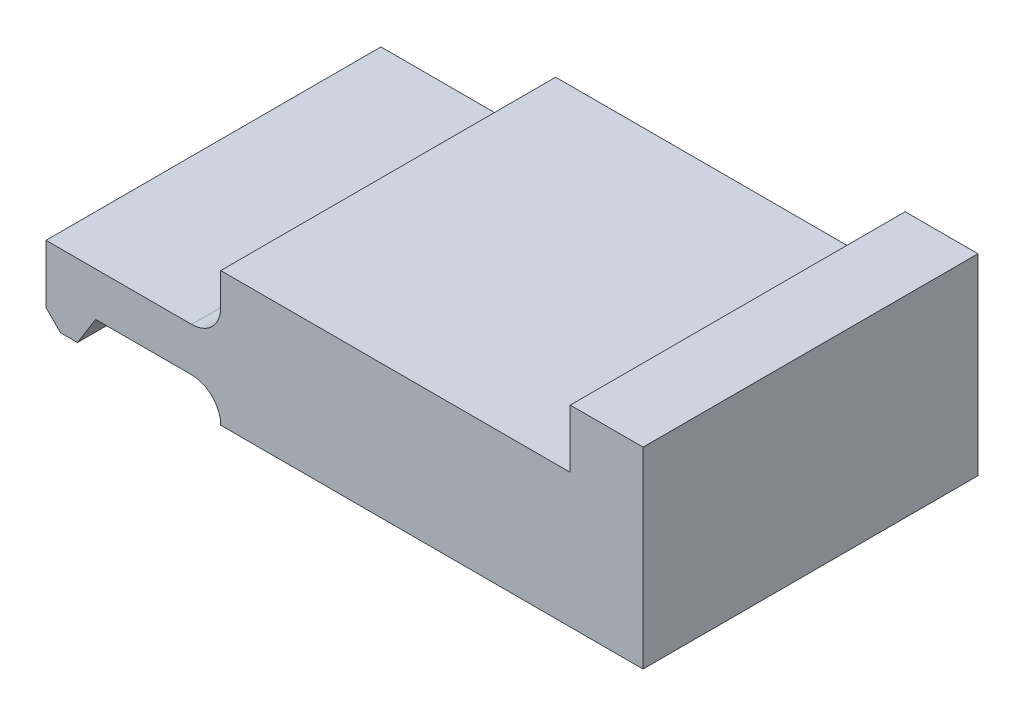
ISO-10303-21;
HEADER;
FILE_DESCRIPTION(('STEP AP214'),'2;1');
FILE_NAME('part.step','',(''),(''),'','','');
FILE_SCHEMA(('AUTOMOTIVE_DESIGN { 1 0 10303 214 1 1 1 1 }'));
ENDSEC;
DATA;
#1=APPLICATION_CONTEXT('core data for automotive mechanical design processes');
#2=APPLICATION_PROTOCOL_DEFINITION('international standard','automotive_design',2000,#1);
#3=PRODUCT_CONTEXT('',#1,'mechanical');
#4=PRODUCT('Part','Part','',(#3));
#5=PRODUCT_RELATED_PRODUCT_CATEGORY('part','',(#4));
#6=PRODUCT_DEFINITION_FORMATION('','',#4);
#7=PRODUCT_DEFINITION_CONTEXT('part definition',#1,'design');
#8=PRODUCT_DEFINITION('design','',#6,#7);
#9=PRODUCT_DEFINITION_SHAPE('','',#8);
#10=(LENGTH_UNIT() NAMED_UNIT(*) SI_UNIT(.MILLI.,.METRE.));
#11=(NAMED_UNIT(*) PLANE_ANGLE_UNIT() SI_UNIT($,.RADIAN.));
#12=(NAMED_UNIT(*) SI_UNIT($,.STERADIAN.) SOLID_ANGLE_UNIT());
#13=UNCERTAINTY_MEASURE_WITH_UNIT(LENGTH_MEASURE(1.E-05),#10,'distance_accuracy_value','');
#14=(GEOMETRIC_REPRESENTATION_CONTEXT(3) GLOBAL_UNCERTAINTY_ASSIGNED_CONTEXT((#13)) GLOBAL_UNIT_ASSIGNED_CONTEXT((#10,
#11,#12)) REPRESENTATION_CONTEXT('',''));
#15=CARTESIAN_POINT('',(0.,0.,0.));
#16=DIRECTION('',(0.,0.,1.));
#17=DIRECTION('',(1.,0.,0.));
#18=AXIS2_PLACEMENT_3D('',#15,#16,#17);
#19=CARTESIAN_POINT('',(0.,0.5,5.75));
#20=DIRECTION('',(0.707106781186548,0.707106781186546,0.));
#21=DIRECTION('',(-0.707106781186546,0.707106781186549,0.));
#22=AXIS2_PLACEMENT_3D('',#19,#20,#21);
#23=PLANE('',#22);
#24=DIRECTION('',(0.707106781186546,-0.707106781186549,0.));
#25=VECTOR('',#24,1.);
#26=CARTESIAN_POINT('',(0.,0.5,-5.75));
#27=LINE('',#26,#25);
#28=CARTESIAN_POINT('',(0.,0.5,-5.75));
#29=VERTEX_POINT('',#28);
#30=CARTESIAN_POINT('',(0.499999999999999,0.,-5.75));
#31=VERTEX_POINT('',#30);
#32=EDGE_CURVE('E147',#29,#31,#27,.T.);
#33=ORIENTED_EDGE('',*,*,#32,.T.);
#34=DIRECTION('',(0.,0.,-1.));
#35=VECTOR('',#34,1.);
#36=CARTESIAN_POINT('',(0.499999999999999,0.,5.75));
#37=LINE('',#36,#35);
#38=CARTESIAN_POINT('',(0.499999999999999,0.,5.75));
#39=VERTEX_POINT('',#38);
#40=EDGE_CURVE('E11',#39,#31,#37,.T.);
#41=ORIENTED_EDGE('',*,*,#40,.F.);
#42=DIRECTION('',(0.707106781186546,-0.707106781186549,0.));
#43=VECTOR('',#42,1.);
#44=CARTESIAN_POINT('',(0.,0.5,5.75));
#45=LINE('',#44,#43);
#46=CARTESIAN_POINT('',(0.,0.5,5.75));
#47=VERTEX_POINT('',#46);
#48=EDGE_CURVE('E169',#47,#39,#45,.T.);
#49=ORIENTED_EDGE('',*,*,#48,.F.);
#50=DIRECTION('',(0.,0.,-1.));
#51=VECTOR('',#50,1.);
#52=CARTESIAN_POINT('',(0.,0.5,5.75));
#53=LINE('',#52,#51);
#54=EDGE_CURVE('E143',#47,#29,#53,.T.);
#55=ORIENTED_EDGE('',*,*,#54,.T.);
#56=EDGE_LOOP('',(#33,#41,#49,#55));
#57=FACE_BOUND('',#56,.T.);
#58=ADVANCED_FACE('F33',(#57),#23,.F.);
#59=CARTESIAN_POINT('',(0.499999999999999,0.,5.75));
#60=DIRECTION('',(0.,1.,0.));
#61=DIRECTION('',(0.,0.,1.));
#62=AXIS2_PLACEMENT_3D('',#59,#60,#61);
#63=PLANE('',#62);
#64=DIRECTION('',(1.,0.,0.));
#65=VECTOR('',#64,1.);
#66=CARTESIAN_POINT('',(0.499999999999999,0.,-5.75));
#67=LINE('',#66,#65);
#68=CARTESIAN_POINT('',(1.08024189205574,0.,-5.75));
#69=VERTEX_POINT('',#68);
#70=EDGE_CURVE('E150',#31,#69,#67,.T.);
#71=ORIENTED_EDGE('',*,*,#70,.T.);
#72=DIRECTION('',(0.,0.,-1.));
#73=VECTOR('',#72,1.);
#74=CARTESIAN_POINT('',(1.08024189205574,0.,5.75));
#75=LINE('',#74,#73);
#76=CARTESIAN_POINT('',(1.08024189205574,0.,5.75));
#77=VERTEX_POINT('',#76);
#78=EDGE_CURVE('E41',#77,#69,#75,.T.);
#79=ORIENTED_EDGE('',*,*,#78,.F.);
#80=DIRECTION('',(1.,0.,0.));
#81=VECTOR('',#80,1.);
#82=CARTESIAN_POINT('',(0.499999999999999,0.,5.75));
#83=LINE('',#82,#81);
#84=EDGE_CURVE('E102',#39,#77,#83,.T.);
#85=ORIENTED_EDGE('',*,*,#84,.F.);
#86=ORIENTED_EDGE('',*,*,#40,.T.);
#87=EDGE_LOOP('',(#71,#79,#85,#86));
#88=FACE_BOUND('',#87,.T.);
#89=ADVANCED_FACE('F245',(#88),#63,.F.);
#90=CARTESIAN_POINT('',(1.08024189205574,0.,5.75));
#91=DIRECTION('',(-0.848343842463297,0.529445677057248,0.));
#92=DIRECTION('',(-0.529445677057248,-0.848343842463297,0.));
#93=AXIS2_PLACEMENT_3D('',#90,#91,#92);
#94=PLANE('',#93);
#95=DIRECTION('',(0.529445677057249,0.848343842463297,0.));
#96=VECTOR('',#95,1.);
#97=CARTESIAN_POINT('',(1.08024189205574,0.,-5.75));
#98=LINE('',#97,#96);
#99=CARTESIAN_POINT('',(1.70433515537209,1.,-5.75));
#100=VERTEX_POINT('',#99);
#101=EDGE_CURVE('E153',#69,#100,#98,.T.);
#102=ORIENTED_EDGE('',*,*,#101,.T.);
#103=DIRECTION('',(0.,0.,-1.));
#104=VECTOR('',#103,1.);
#105=CARTESIAN_POINT('',(1.70433515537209,1.,5.75));
#106=LINE('',#105,#104);
#107=CARTESIAN_POINT('',(1.70433515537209,1.,5.75));
#108=VERTEX_POINT('',#107);
#109=EDGE_CURVE('E185',#108,#100,#106,.T.);
#110=ORIENTED_EDGE('',*,*,#109,.F.);
#111=DIRECTION('',(0.529445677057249,0.848343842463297,0.));
#112=VECTOR('',#111,1.);
#113=CARTESIAN_POINT('',(1.08024189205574,0.,5.75));
#114=LINE('',#113,#112);
#115=EDGE_CURVE('E193',#77,#108,#114,.T.);
#116=ORIENTED_EDGE('',*,*,#115,.F.);
#117=ORIENTED_EDGE('',*,*,#78,.T.);
#118=EDGE_LOOP('',(#102,#110,#116,#117));
#119=FACE_BOUND('',#118,.T.);
#120=ADVANCED_FACE('F191',(#119),#94,.F.);
#121=CARTESIAN_POINT('',(1.70433515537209,1.,5.75));
#122=DIRECTION('',(0.,1.,0.));
#123=DIRECTION('',(-1.,0.,0.));
#124=AXIS2_PLACEMENT_3D('',#121,#122,#123);
#125=PLANE('',#124);
#126=DIRECTION('',(1.,0.,0.));
#127=VECTOR('',#126,1.);
#128=CARTESIAN_POINT('',(1.70433515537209,1.,-5.75));
#129=LINE('',#128,#127);
#130=CARTESIAN_POINT('',(5.,0.999999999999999,-5.75));
#131=VERTEX_POINT('',#130);
#132=EDGE_CURVE('E155',#100,#131,#129,.T.);
#133=ORIENTED_EDGE('',*,*,#132,.T.);
#134=DIRECTION('',(0.,0.,-1.));
#135=VECTOR('',#134,1.);
#136=CARTESIAN_POINT('',(5.,0.999999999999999,5.75));
#137=LINE('',#136,#135);
#138=CARTESIAN_POINT('',(5.,0.999999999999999,5.75));
#139=VERTEX_POINT('',#138);
#140=EDGE_CURVE('E182',#139,#131,#137,.T.);
#141=ORIENTED_EDGE('',*,*,#140,.F.);
#142=DIRECTION('',(1.,0.,0.));
#143=VECTOR('',#142,1.);
#144=CARTESIAN_POINT('',(1.70433515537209,1.,5.75));
#145=LINE('',#144,#143);
#146=EDGE_CURVE('E212',#108,#139,#145,.T.);
#147=ORIENTED_EDGE('',*,*,#146,.F.);
#148=ORIENTED_EDGE('',*,*,#109,.T.);
#149=EDGE_LOOP('',(#133,#141,#147,#148));
#150=FACE_BOUND('',#149,.T.);
#151=ADVANCED_FACE('F202',(#150),#125,.F.);
#152=CARTESIAN_POINT('',(5.,0.,5.75));
#153=DIRECTION('',(0.,0.,-1.));
#154=DIRECTION('',(-1.,0.,0.));
#155=AXIS2_PLACEMENT_3D('',#152,#153,#154);
#156=CYLINDRICAL_SURFACE('',#155,0.999999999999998);
#157=CARTESIAN_POINT('',(5.,0.,-5.75));
#158=DIRECTION('',(0.,0.,-1.));
#159=DIRECTION('',(-1.,0.,0.));
#160=AXIS2_PLACEMENT_3D('',#157,#158,#159);
#161=CIRCLE('',#160,0.999999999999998);
#162=CARTESIAN_POINT('',(6.,0.,-5.75));
#163=VERTEX_POINT('',#162);
#164=EDGE_CURVE('E157',#131,#163,#161,.T.);
#165=ORIENTED_EDGE('',*,*,#164,.T.);
#166=DIRECTION('',(0.,0.,-1.));
#167=VECTOR('',#166,1.);
#168=CARTESIAN_POINT('',(6.,0.,5.75));
#169=LINE('',#168,#167);
#170=CARTESIAN_POINT('',(6.,0.,5.75));
#171=VERTEX_POINT('',#170);
#172=EDGE_CURVE('E179',#171,#163,#169,.T.);
#173=ORIENTED_EDGE('',*,*,#172,.F.);
#174=CARTESIAN_POINT('',(5.,0.,5.75));
#175=DIRECTION('',(0.,0.,-1.));
#176=DIRECTION('',(-1.,0.,0.));
#177=AXIS2_PLACEMENT_3D('',#174,#175,#176);
#178=CIRCLE('',#177,0.999999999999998);
#179=EDGE_CURVE('E208',#139,#171,#178,.T.);
#180=ORIENTED_EDGE('',*,*,#179,.F.);
#181=ORIENTED_EDGE('',*,*,#140,.T.);
#182=EDGE_LOOP('',(#165,#173,#180,#181));
#183=FACE_BOUND('',#182,.T.);
#184=ADVANCED_FACE('F206',(#183),#156,.F.);
#185=CARTESIAN_POINT('',(6.,0.,5.75));
#186=DIRECTION('',(0.,1.,0.));
#187=DIRECTION('',(-1.,0.,0.));
#188=AXIS2_PLACEMENT_3D('',#185,#186,#187);
#189=PLANE('',#188);
#190=DIRECTION('',(1.,0.,0.));
#191=VECTOR('',#190,1.);
#192=CARTESIAN_POINT('',(6.,0.,-5.75));
#193=LINE('',#192,#191);
#194=CARTESIAN_POINT('',(20.5,0.,-5.75));
#195=VERTEX_POINT('',#194);
#196=EDGE_CURVE('E159',#163,#195,#193,.T.);
#197=ORIENTED_EDGE('',*,*,#196,.T.);
#198=DIRECTION('',(0.,0.,-1.));
#199=VECTOR('',#198,1.);
#200=CARTESIAN_POINT('',(20.5,0.,-5.75));
#201=LINE('',#200,#199);
#202=CARTESIAN_POINT('',(20.5,0.,5.75));
#203=VERTEX_POINT('',#202);
#204=EDGE_CURVE('E365',#203,#195,#201,.T.);
#205=ORIENTED_EDGE('',*,*,#204,.F.);
#206=DIRECTION('',(1.,0.,0.));
#207=VECTOR('',#206,1.);
#208=CARTESIAN_POINT('',(6.,0.,5.75));
#209=LINE('',#208,#207);
#210=EDGE_CURVE('E211',#171,#203,#209,.T.);
#211=ORIENTED_EDGE('',*,*,#210,.F.);
#212=ORIENTED_EDGE('',*,*,#172,.T.);
#213=EDGE_LOOP('',(#197,#205,#211,#212));
#214=FACE_BOUND('',#213,.T.);
#215=ADVANCED_FACE('F258',(#214),#189,.F.);
#216=CARTESIAN_POINT('',(18.,4.6,5.75));
#217=DIRECTION('',(0.,-1.,0.));
#218=DIRECTION('',(1.,0.,0.));
#219=AXIS2_PLACEMENT_3D('',#216,#217,#218);
#220=PLANE('',#219);
#221=DIRECTION('',(-1.,0.,0.));
#222=VECTOR('',#221,1.);
#223=CARTESIAN_POINT('',(18.,4.6,-5.75));
#224=LINE('',#223,#222);
#225=CARTESIAN_POINT('',(18.,4.6,-5.75));
#226=VERTEX_POINT('',#225);
#227=CARTESIAN_POINT('',(6.,4.6,-5.75));
#228=VERTEX_POINT('',#227);
#229=EDGE_CURVE('E162',#226,#228,#224,.T.);
#230=ORIENTED_EDGE('',*,*,#229,.T.);
#231=DIRECTION('',(0.,0.,-1.));
#232=VECTOR('',#231,1.);
#233=CARTESIAN_POINT('',(6.,4.6,5.75));
#234=LINE('',#233,#232);
#235=CARTESIAN_POINT('',(6.,4.6,5.75));
#236=VERTEX_POINT('',#235);
#237=EDGE_CURVE('E173',#236,#228,#234,.T.);
#238=ORIENTED_EDGE('',*,*,#237,.F.);
#239=DIRECTION('',(-1.,0.,0.));
#240=VECTOR('',#239,1.);
#241=CARTESIAN_POINT('',(18.,4.6,5.75));
#242=LINE('',#241,#240);
#243=CARTESIAN_POINT('',(18.,4.6,5.75));
#244=VERTEX_POINT('',#243);
#245=EDGE_CURVE('E214',#244,#236,#242,.T.);
#246=ORIENTED_EDGE('',*,*,#245,.F.);
#247=DIRECTION('',(0.,0.,-1.));
#248=VECTOR('',#247,1.);
#249=CARTESIAN_POINT('',(18.,4.6,5.75));
#250=LINE('',#249,#248);
#251=EDGE_CURVE('E176',#244,#226,#250,.T.);
#252=ORIENTED_EDGE('',*,*,#251,.T.);
#253=EDGE_LOOP('',(#230,#238,#246,#252));
#254=FACE_BOUND('',#253,.T.);
#255=ADVANCED_FACE('F226',(#254),#220,.F.);
#256=CARTESIAN_POINT('',(6.,4.6,5.75));
#257=DIRECTION('',(1.,0.,0.));
#258=DIRECTION('',(0.,1.,0.));
#259=AXIS2_PLACEMENT_3D('',#256,#257,#258);
#260=PLANE('',#259);
#261=DIRECTION('',(0.,-1.,0.));
#262=VECTOR('',#261,1.);
#263=CARTESIAN_POINT('',(6.,4.6,-5.75));
#264=LINE('',#263,#262);
#265=CARTESIAN_POINT('',(6.,3.5,-5.75));
#266=VERTEX_POINT('',#265);
#267=EDGE_CURVE('E164',#228,#266,#264,.T.);
#268=ORIENTED_EDGE('',*,*,#267,.T.);
#269=DIRECTION('',(0.,0.,-1.));
#270=VECTOR('',#269,1.);
#271=CARTESIAN_POINT('',(6.,3.5,5.75));
#272=LINE('',#271,#270);
#273=CARTESIAN_POINT('',(6.,3.5,5.75));
#274=VERTEX_POINT('',#273);
#275=EDGE_CURVE('E138',#274,#266,#272,.T.);
#276=ORIENTED_EDGE('',*,*,#275,.F.);
#277=DIRECTION('',(0.,-1.,0.));
#278=VECTOR('',#277,1.);
#279=CARTESIAN_POINT('',(6.,4.6,5.75));
#280=LINE('',#279,#278);
#281=EDGE_CURVE('E129',#236,#274,#280,.T.);
#282=ORIENTED_EDGE('',*,*,#281,.F.);
#283=ORIENTED_EDGE('',*,*,#237,.T.);
#284=EDGE_LOOP('',(#268,#276,#282,#283));
#285=FACE_BOUND('',#284,.T.);
#286=ADVANCED_FACE('F230',(#285),#260,.F.);
#287=CARTESIAN_POINT('',(5.,3.5,5.75));
#288=DIRECTION('',(0.,0.,-1.));
#289=DIRECTION('',(-1.,0.,0.));
#290=AXIS2_PLACEMENT_3D('',#287,#288,#289);
#291=CYLINDRICAL_SURFACE('',#290,1.);
#292=CARTESIAN_POINT('',(5.,3.5,-5.75));
#293=DIRECTION('',(0.,0.,-1.));
#294=DIRECTION('',(1.,0.,0.));
#295=AXIS2_PLACEMENT_3D('',#292,#293,#294);
#296=CIRCLE('',#295,1.);
#297=CARTESIAN_POINT('',(5.,2.5,-5.75));
#298=VERTEX_POINT('',#297);
#299=EDGE_CURVE('E137',#266,#298,#296,.T.);
#300=ORIENTED_EDGE('',*,*,#299,.T.);
#301=DIRECTION('',(0.,0.,-1.));
#302=VECTOR('',#301,1.);
#303=CARTESIAN_POINT('',(5.,2.5,5.75));
#304=LINE('',#303,#302);
#305=CARTESIAN_POINT('',(5.,2.5,5.75));
#306=VERTEX_POINT('',#305);
#307=EDGE_CURVE('E134',#306,#298,#304,.T.);
#308=ORIENTED_EDGE('',*,*,#307,.F.);
#309=CARTESIAN_POINT('',(5.,3.5,5.75));
#310=DIRECTION('',(0.,0.,-1.));
#311=DIRECTION('',(1.,0.,0.));
#312=AXIS2_PLACEMENT_3D('',#309,#310,#311);
#313=CIRCLE('',#312,1.);
#314=EDGE_CURVE('E123',#274,#306,#313,.T.);
#315=ORIENTED_EDGE('',*,*,#314,.F.);
#316=ORIENTED_EDGE('',*,*,#275,.T.);
#317=EDGE_LOOP('',(#300,#308,#315,#316));
#318=FACE_BOUND('',#317,.T.);
#319=ADVANCED_FACE('F135',(#318),#291,.F.);
#320=CARTESIAN_POINT('',(5.,2.5,5.75));
#321=DIRECTION('',(0.,-1.,0.));
#322=DIRECTION('',(0.,0.,-1.));
#323=AXIS2_PLACEMENT_3D('',#320,#321,#322);
#324=PLANE('',#323);
#325=DIRECTION('',(-1.,0.,0.));
#326=VECTOR('',#325,1.);
#327=CARTESIAN_POINT('',(5.,2.5,-5.75));
#328=LINE('',#327,#326);
#329=CARTESIAN_POINT('',(0.,2.5,-5.75));
#330=VERTEX_POINT('',#329);
#331=EDGE_CURVE('E88',#298,#330,#328,.T.);
#332=ORIENTED_EDGE('',*,*,#331,.T.);
#333=DIRECTION('',(0.,0.,-1.));
#334=VECTOR('',#333,1.);
#335=CARTESIAN_POINT('',(0.,2.5,5.75));
#336=LINE('',#335,#334);
#337=CARTESIAN_POINT('',(0.,2.5,5.75));
#338=VERTEX_POINT('',#337);
#339=EDGE_CURVE('E139',#338,#330,#336,.T.);
#340=ORIENTED_EDGE('',*,*,#339,.F.);
#341=DIRECTION('',(-1.,0.,0.));
#342=VECTOR('',#341,1.);
#343=CARTESIAN_POINT('',(5.,2.5,5.75));
#344=LINE('',#343,#342);
#345=EDGE_CURVE('E127',#306,#338,#344,.T.);
#346=ORIENTED_EDGE('',*,*,#345,.F.);
#347=ORIENTED_EDGE('',*,*,#307,.T.);
#348=EDGE_LOOP('',(#332,#340,#346,#347));
#349=FACE_BOUND('',#348,.T.);
#350=ADVANCED_FACE('F141',(#349),#324,.F.);
#351=CARTESIAN_POINT('',(0.,2.5,5.75));
#352=DIRECTION('',(1.,0.,0.));
#353=DIRECTION('',(0.,1.,0.));
#354=AXIS2_PLACEMENT_3D('',#351,#352,#353);
#355=PLANE('',#354);
#356=DIRECTION('',(0.,-1.,0.));
#357=VECTOR('',#356,1.);
#358=CARTESIAN_POINT('',(0.,2.5,-5.75));
#359=LINE('',#358,#357);
#360=EDGE_CURVE('E94',#330,#29,#359,.T.);
#361=ORIENTED_EDGE('',*,*,#360,.T.);
#362=ORIENTED_EDGE('',*,*,#54,.F.);
#363=DIRECTION('',(0.,-1.,0.));
#364=VECTOR('',#363,1.);
#365=CARTESIAN_POINT('',(0.,2.5,5.75));
#366=LINE('',#365,#364);
#367=EDGE_CURVE('E49',#338,#47,#366,.T.);
#368=ORIENTED_EDGE('',*,*,#367,.F.);
#369=ORIENTED_EDGE('',*,*,#339,.T.);
#370=EDGE_LOOP('',(#361,#362,#368,#369));
#371=FACE_BOUND('',#370,.T.);
#372=ADVANCED_FACE('F234',(#371),#355,.F.);
#373=CARTESIAN_POINT('',(5.,0.,5.75));
#374=DIRECTION('',(0.,0.,-1.));
#375=DIRECTION('',(-1.,0.,0.));
#376=AXIS2_PLACEMENT_3D('',#373,#374,#375);
#377=PLANE('',#376);
#378=ORIENTED_EDGE('',*,*,#48,.T.);
#379=ORIENTED_EDGE('',*,*,#84,.T.);
#380=ORIENTED_EDGE('',*,*,#115,.T.);
#381=ORIENTED_EDGE('',*,*,#146,.T.);
#382=ORIENTED_EDGE('',*,*,#179,.T.);
#383=ORIENTED_EDGE('',*,*,#210,.T.);
#384=DIRECTION('',(0.,-1.,0.));
#385=VECTOR('',#384,1.);
#386=CARTESIAN_POINT('',(20.5,0.,5.75));
#387=LINE('',#386,#385);
#388=CARTESIAN_POINT('',(20.5,6.59999999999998,5.75));
#389=VERTEX_POINT('',#388);
#390=EDGE_CURVE('E374',#389,#203,#387,.T.);
#391=ORIENTED_EDGE('',*,*,#390,.F.);
#392=DIRECTION('',(-1.,0.,0.));
#393=VECTOR('',#392,1.);
#394=CARTESIAN_POINT('',(20.5,6.59999999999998,5.75));
#395=LINE('',#394,#393);
#396=CARTESIAN_POINT('',(18.,6.59999999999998,5.75));
#397=VERTEX_POINT('',#396);
#398=EDGE_CURVE('E363',#389,#397,#395,.T.);
#399=ORIENTED_EDGE('',*,*,#398,.T.);
#400=DIRECTION('',(0.,-1.,0.));
#401=VECTOR('',#400,1.);
#402=CARTESIAN_POINT('',(18.,0.,5.75));
#403=LINE('',#402,#401);
#404=EDGE_CURVE('E224',#397,#244,#403,.T.);
#405=ORIENTED_EDGE('',*,*,#404,.T.);
#406=ORIENTED_EDGE('',*,*,#245,.T.);
#407=ORIENTED_EDGE('',*,*,#281,.T.);
#408=ORIENTED_EDGE('',*,*,#314,.T.);
#409=ORIENTED_EDGE('',*,*,#345,.T.);
#410=ORIENTED_EDGE('',*,*,#367,.T.);
#411=EDGE_LOOP('',(#378,#379,#380,#381,#382,#383,#391,#399,#405,#406,#407,#408,#409,#410));
#412=FACE_BOUND('',#411,.T.);
#413=ADVANCED_FACE('F125',(#412),#377,.F.);
#414=CARTESIAN_POINT('',(5.,0.,-5.75));
#415=DIRECTION('',(0.,0.,-1.));
#416=DIRECTION('',(-1.,0.,0.));
#417=AXIS2_PLACEMENT_3D('',#414,#415,#416);
#418=PLANE('',#417);
#419=ORIENTED_EDGE('',*,*,#32,.F.);
#420=ORIENTED_EDGE('',*,*,#360,.F.);
#421=ORIENTED_EDGE('',*,*,#331,.F.);
#422=ORIENTED_EDGE('',*,*,#299,.F.);
#423=ORIENTED_EDGE('',*,*,#267,.F.);
#424=ORIENTED_EDGE('',*,*,#229,.F.);
#425=DIRECTION('',(0.,1.,0.));
#426=VECTOR('',#425,1.);
#427=CARTESIAN_POINT('',(18.,0.,-5.75));
#428=LINE('',#427,#426);
#429=CARTESIAN_POINT('',(18.,6.59999999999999,-5.75));
#430=VERTEX_POINT('',#429);
#431=EDGE_CURVE('E346',#226,#430,#428,.T.);
#432=ORIENTED_EDGE('',*,*,#431,.T.);
#433=DIRECTION('',(-1.,0.,0.));
#434=VECTOR('',#433,1.);
#435=CARTESIAN_POINT('',(20.5,6.59999999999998,-5.75));
#436=LINE('',#435,#434);
#437=CARTESIAN_POINT('',(20.5,6.59999999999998,-5.75));
#438=VERTEX_POINT('',#437);
#439=EDGE_CURVE('E151',#438,#430,#436,.T.);
#440=ORIENTED_EDGE('',*,*,#439,.F.);
#441=DIRECTION('',(0.,1.,0.));
#442=VECTOR('',#441,1.);
#443=CARTESIAN_POINT('',(20.5,0.,-5.75));
#444=LINE('',#443,#442);
#445=EDGE_CURVE('E370',#195,#438,#444,.T.);
#446=ORIENTED_EDGE('',*,*,#445,.F.);
#447=ORIENTED_EDGE('',*,*,#196,.F.);
#448=ORIENTED_EDGE('',*,*,#164,.F.);
#449=ORIENTED_EDGE('',*,*,#132,.F.);
#450=ORIENTED_EDGE('',*,*,#101,.F.);
#451=ORIENTED_EDGE('',*,*,#70,.F.);
#452=EDGE_LOOP('',(#419,#420,#421,#422,#423,#424,#432,#440,#446,#447,#448,#449,#450,#451));
#453=FACE_BOUND('',#452,.T.);
#454=ADVANCED_FACE('F197',(#453),#418,.T.);
#455=CARTESIAN_POINT('',(20.5,6.59999999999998,-5.75));
#456=DIRECTION('',(0.,-1.,0.));
#457=DIRECTION('',(1.,0.,0.));
#458=AXIS2_PLACEMENT_3D('',#455,#456,#457);
#459=PLANE('',#458);
#460=DIRECTION('',(0.,0.,1.));
#461=VECTOR('',#460,1.);
#462=CARTESIAN_POINT('',(18.,6.59999999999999,-5.75));
#463=LINE('',#462,#461);
#464=EDGE_CURVE('E354',#430,#397,#463,.T.);
#465=ORIENTED_EDGE('',*,*,#464,.T.);
#466=ORIENTED_EDGE('',*,*,#398,.F.);
#467=DIRECTION('',(0.,0.,1.));
#468=VECTOR('',#467,1.);
#469=CARTESIAN_POINT('',(20.5,6.59999999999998,-5.75));
#470=LINE('',#469,#468);
#471=EDGE_CURVE('E361',#438,#389,#470,.T.);
#472=ORIENTED_EDGE('',*,*,#471,.F.);
#473=ORIENTED_EDGE('',*,*,#439,.T.);
#474=EDGE_LOOP('',(#465,#466,#472,#473));
#475=FACE_BOUND('',#474,.T.);
#476=ADVANCED_FACE('F310',(#475),#459,.F.);
#477=CARTESIAN_POINT('',(20.5,0.,0.));
#478=DIRECTION('',(1.,0.,0.));
#479=DIRECTION('',(0.,1.,0.));
#480=AXIS2_PLACEMENT_3D('',#477,#478,#479);
#481=PLANE('',#480);
#482=ORIENTED_EDGE('',*,*,#445,.T.);
#483=ORIENTED_EDGE('',*,*,#471,.T.);
#484=ORIENTED_EDGE('',*,*,#390,.T.);
#485=ORIENTED_EDGE('',*,*,#204,.T.);
#486=EDGE_LOOP('',(#482,#483,#484,#485));
#487=FACE_BOUND('',#486,.T.);
#488=ADVANCED_FACE('F318',(#487),#481,.T.);
#489=CARTESIAN_POINT('',(18.,0.,0.));
#490=DIRECTION('',(1.,0.,0.));
#491=DIRECTION('',(0.,1.,0.));
#492=AXIS2_PLACEMENT_3D('',#489,#490,#491);
#493=PLANE('',#492);
#494=ORIENTED_EDGE('',*,*,#251,.F.);
#495=ORIENTED_EDGE('',*,*,#404,.F.);
#496=ORIENTED_EDGE('',*,*,#464,.F.);
#497=ORIENTED_EDGE('',*,*,#431,.F.);
#498=EDGE_LOOP('',(#494,#495,#496,#497));
#499=FACE_BOUND('',#498,.T.);
#500=ADVANCED_FACE('F328',(#499),#493,.F.);
#501=CLOSED_SHELL('',(#58,#89,#120,#151,#184,#215,#255,#286,#319,#350,#372,#413,#454,#476,#488,#500));
#502=MANIFOLD_SOLID_BREP('B2',#501);
#503=ADVANCED_BREP_SHAPE_REPRESENTATION('',(#18,#502),#14);
#504=SHAPE_DEFINITION_REPRESENTATION(#9,#503);
ENDSEC;
END-ISO-10303-21;
